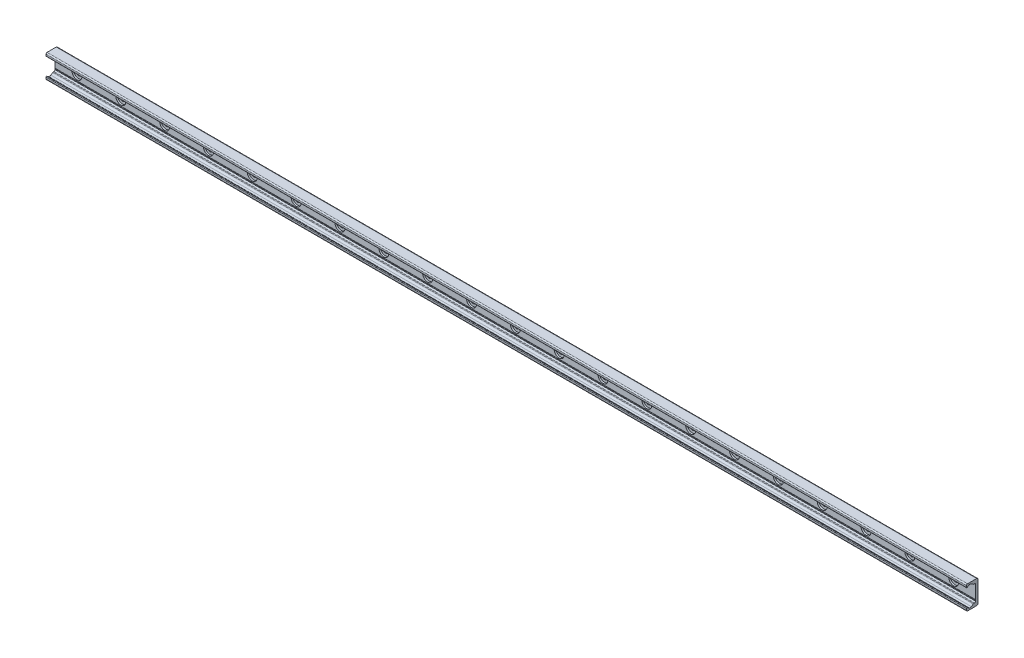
from build123d import *

# Parameters (mm, degrees)
BOSS_EXTRUDE1_DEPTH = 840
SKETCH2_R           = 9
SKETCH2_R_2         = 4.5
CUT_EXTRUDE1_DEPTH  = 3.1
SKETCH2_2_R         = 4.5
CUT_EXTRUDE2_DEPTH  = 841.437088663
LPATTERN1_COUNT     = 21
LPATTERN1_PITCH     = 80


with BuildPart() as part:
    # Sketch1 → Boss-Extrude1 (new, symmetric)
    with BuildSketch(Plane(origin=(0, 0, 0), x_dir=(0, 0, -1), z_dir=(1, 0, 0))):
        with BuildLine():
            Line((0, 0), (0, 19))
            ThreePointArc((0, 19), (-0.732233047, 20.767766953), (-2.5, 21.5))
            Line((-2.5, 21.5), (-19, 21.5))
            ThreePointArc((-19, 21.5), (-20.414213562, 20.914213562), (-21, 19.5))
            Line((-21, 19.5), (-21, 16.625057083))
            ThreePointArc((-21, 16.625057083), (-20.553251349, 15.888838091), (-19.693931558, 15.945160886))
            Line((-19.693931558, 15.945160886), (-16.794305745, 17.975500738))
            ThreePointArc((-16.794305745, 17.975500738), (-14.5, 18.69889256), (-12.205694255, 17.975500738))
            Line((-12.205694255, 17.975500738), (-8.829831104, 15.611695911))
            ThreePointArc((-8.829831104, 15.611695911), (-8.28408983, 15.342566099), (-7.682678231, 15.25))
            Line((-7.682678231, 15.25), (-6.5, 15.25))
            ThreePointArc((-6.5, 15.25), (-5.085786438, 14.664213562), (-4.5, 13.25))
            Line((-4.5, 13.25), (-4.5, -10.75))
            ThreePointArc((-4.5, -10.75), (-4.25, -11), (-4.5, -11.25))
            Line((-4.5, -11.25), (-4.5, -12.25))
            ThreePointArc((-4.5, -12.25), (-4.25, -12.5), (-4.5, -12.75))
            Line((-4.5, -12.75), (-4.5, -13.25))
            ThreePointArc((-4.5, -13.25), (-5.085786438, -14.664213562), (-6.5, -15.25))
            Line((-6.5, -15.25), (-7.682678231, -15.25))
            ThreePointArc((-7.682678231, -15.25), (-8.28408983, -15.342566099), (-8.829831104, -15.611695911))
            Line((-8.829831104, -15.611695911), (-12.205694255, -17.975500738))
            ThreePointArc((-12.205694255, -17.975500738), (-14.5, -18.69889256), (-16.794305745, -17.975500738))
            Line((-16.794305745, -17.975500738), (-19.693931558, -15.945160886))
            ThreePointArc((-19.693931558, -15.945160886), (-20.553251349, -15.888838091), (-21, -16.625057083))
            Line((-21, -16.625057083), (-21, -19.5))
            ThreePointArc((-21, -19.5), (-20.414213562, -20.914213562), (-19, -21.5))
            Line((-19, -21.5), (-2.5, -21.5))
            ThreePointArc((-2.5, -21.5), (-0.732233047, -20.767766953), (0, -19))
            Line((0, -19), (0, 0))
        make_face()
    extrude(amount=BOSS_EXTRUDE1_DEPTH, both=True)

    # Sketch2 → Cut-Extrude1 (cut)
    with BuildSketch(Plane.XY.offset(4.5)):
        with Locations((800, 0)):
            Circle(SKETCH2_R)
        with Locations((800, 0)):
            Circle(SKETCH2_R_2, mode=Mode.SUBTRACT)
    cut_extrude1 = extrude(amount=-CUT_EXTRUDE1_DEPTH, mode=Mode.SUBTRACT)

    # Sketch2_2 → Cut-Extrude2 (cut, through all)
    with BuildSketch(Plane.XY.offset(4.5)):
        with Locations((800, 0)):
            Circle(SKETCH2_2_R)
    cut_extrude2 = extrude(amount=-CUT_EXTRUDE2_DEPTH, mode=Mode.SUBTRACT)

    # LPattern1: Cut-Extrude1, Cut-Extrude2 ×21
    with Locations(*[(-i * LPATTERN1_PITCH, 0, 0) for i in range(1, LPATTERN1_COUNT)]):
        add(cut_extrude1, mode=Mode.SUBTRACT)
        add(cut_extrude2, mode=Mode.SUBTRACT)


solid = part.part
